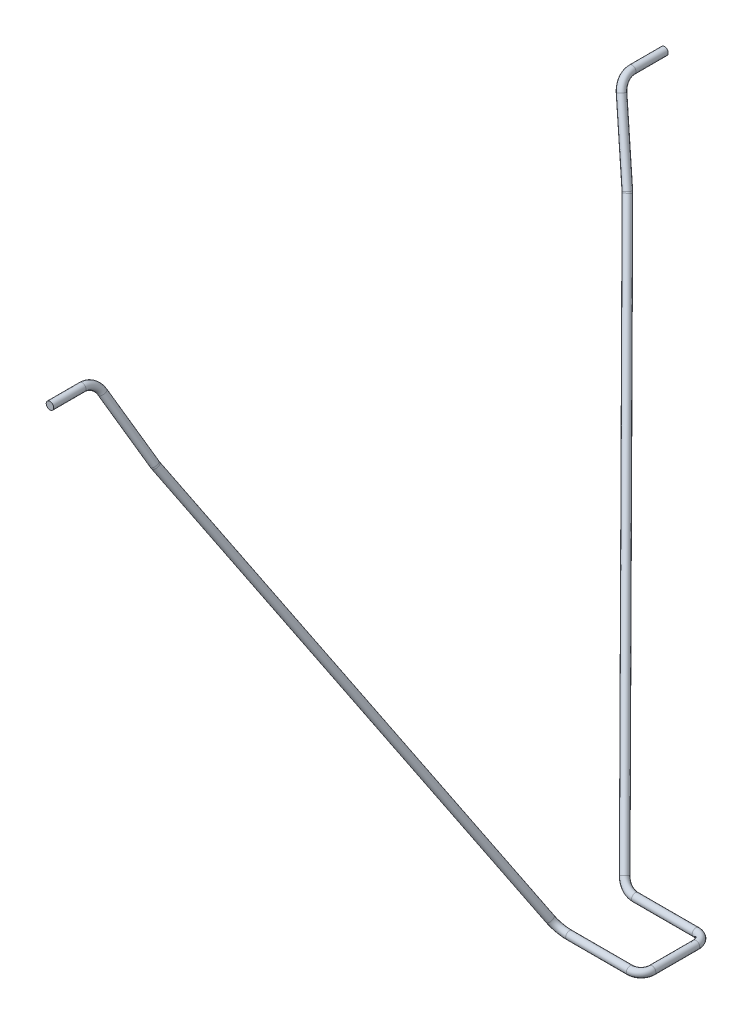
ISO-10303-21;
HEADER;
FILE_DESCRIPTION(('STEP AP214'),'2;1');
FILE_NAME('part.step','',(''),(''),'','','');
FILE_SCHEMA(('AUTOMOTIVE_DESIGN { 1 0 10303 214 1 1 1 1 }'));
ENDSEC;
DATA;
#1=APPLICATION_CONTEXT('core data for automotive mechanical design processes');
#2=APPLICATION_PROTOCOL_DEFINITION('international standard','automotive_design',2000,#1);
#3=PRODUCT_CONTEXT('',#1,'mechanical');
#4=PRODUCT('Part','Part','',(#3));
#5=PRODUCT_RELATED_PRODUCT_CATEGORY('part','',(#4));
#6=PRODUCT_DEFINITION_FORMATION('','',#4);
#7=PRODUCT_DEFINITION_CONTEXT('part definition',#1,'design');
#8=PRODUCT_DEFINITION('design','',#6,#7);
#9=PRODUCT_DEFINITION_SHAPE('','',#8);
#10=(LENGTH_UNIT() NAMED_UNIT(*) SI_UNIT(.MILLI.,.METRE.));
#11=(NAMED_UNIT(*) PLANE_ANGLE_UNIT() SI_UNIT($,.RADIAN.));
#12=(NAMED_UNIT(*) SI_UNIT($,.STERADIAN.) SOLID_ANGLE_UNIT());
#13=UNCERTAINTY_MEASURE_WITH_UNIT(LENGTH_MEASURE(1.E-05),#10,'distance_accuracy_value','');
#14=(GEOMETRIC_REPRESENTATION_CONTEXT(3) GLOBAL_UNCERTAINTY_ASSIGNED_CONTEXT((#13)) GLOBAL_UNIT_ASSIGNED_CONTEXT((#10,
#11,#12)) REPRESENTATION_CONTEXT('',''));
#15=CARTESIAN_POINT('',(0.,0.,0.));
#16=DIRECTION('',(0.,0.,1.));
#17=DIRECTION('',(1.,0.,0.));
#18=AXIS2_PLACEMENT_3D('',#15,#16,#17);
#19=CARTESIAN_POINT('',(-57.7124002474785,86.187973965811,50.104244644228));
#20=DIRECTION('',(0.,0.,1.));
#21=DIRECTION('',(1.,0.,0.));
#22=AXIS2_PLACEMENT_3D('',#19,#20,#21);
#23=CYLINDRICAL_SURFACE('',#22,0.685);
#24=CARTESIAN_POINT('',(-57.7124002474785,86.187973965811,50.104244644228));
#25=DIRECTION('',(0.,0.,1.));
#26=DIRECTION('',(0.660645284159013,-0.750698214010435,0.));
#27=AXIS2_PLACEMENT_3D('',#24,#25,#26);
#28=CIRCLE('',#27,0.685);
#29=CARTESIAN_POINT('',(-58.012684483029,86.8036478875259,50.104244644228));
#30=VERTEX_POINT('',#29);
#31=EDGE_CURVE('E42',#30,#30,#28,.T.);
#32=ORIENTED_EDGE('',*,*,#31,.T.);
#33=EDGE_LOOP('',(#32));
#34=FACE_BOUND('',#33,.T.);
#35=CARTESIAN_POINT('',(-57.7124002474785,86.187973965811,55.979804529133));
#36=DIRECTION('',(0.,0.,1.));
#37=DIRECTION('',(0.660645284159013,-0.750698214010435,0.));
#38=AXIS2_PLACEMENT_3D('',#35,#36,#37);
#39=CIRCLE('',#38,0.685);
#40=CARTESIAN_POINT('',(-57.2598582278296,85.6737456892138,55.979804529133));
#41=VERTEX_POINT('',#40);
#42=EDGE_CURVE('E12',#41,#41,#39,.T.);
#43=ORIENTED_EDGE('',*,*,#42,.F.);
#44=EDGE_LOOP('',(#43));
#45=FACE_BOUND('',#44,.T.);
#46=ADVANCED_FACE('F36',(#34,#45),#23,.T.);
#47=CARTESIAN_POINT('',(-56.3972868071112,83.4915918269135,50.104244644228));
#48=DIRECTION('',(0.898794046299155,0.438371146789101,0.));
#49=DIRECTION('',(-0.438371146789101,0.898794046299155,0.));
#50=AXIS2_PLACEMENT_3D('',#47,#48,#49);
#51=TOROIDAL_SURFACE('',#50,3.,0.685);
#52=CARTESIAN_POINT('',(-56.8320089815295,84.3829043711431,47.2728883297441));
#53=DIRECTION('',(-0.413728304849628,0.848268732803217,0.330558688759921));
#54=DIRECTION('',(0.377649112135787,-0.170470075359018,0.910121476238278));
#55=AXIS2_PLACEMENT_3D('',#52,#53,#54);
#56=CIRCLE('',#55,0.685);
#57=CARTESIAN_POINT('',(-56.9312705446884,84.5864207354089,46.6263953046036));
#58=VERTEX_POINT('',#57);
#59=EDGE_CURVE('E46',#58,#58,#56,.T.);
#60=CARTESIAN_POINT('',(-56.3972868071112,83.4915918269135,50.104244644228));
#61=DIRECTION('',(0.898794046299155,0.438371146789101,0.));
#62=DIRECTION('',(-0.438371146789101,0.898794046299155,0.));
#63=AXIS2_PLACEMENT_3D('',#60,#61,#62);
#64=CIRCLE('',#63,3.685);
#65=EDGE_CURVE('',#58,#30,#64,.T.);
#66=ORIENTED_EDGE('',*,*,#59,.T.);
#67=ORIENTED_EDGE('',*,*,#31,.F.);
#68=ORIENTED_EDGE('',*,*,#65,.T.);
#69=ORIENTED_EDGE('',*,*,#65,.F.);
#70=EDGE_LOOP('',(#66,#68,#67,#69));
#71=FACE_BOUND('',#70,.T.);
#72=ADVANCED_FACE('F155',(#71),#51,.T.);
#73=CARTESIAN_POINT('',(-51.5606669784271,73.5750516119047,43.0612163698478));
#74=DIRECTION('',(-0.413728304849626,0.848268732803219,0.330558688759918));
#75=DIRECTION('',(-0.898794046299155,-0.438371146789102,0.));
#76=AXIS2_PLACEMENT_3D('',#73,#74,#75);
#77=CYLINDRICAL_SURFACE('',#76,0.685);
#78=CARTESIAN_POINT('',(-51.5606669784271,73.5750516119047,43.0612163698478));
#79=DIRECTION('',(-0.413728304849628,0.848268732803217,0.330558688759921));
#80=DIRECTION('',(0.377649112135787,-0.170470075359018,0.910121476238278));
#81=AXIS2_PLACEMENT_3D('',#78,#79,#80);
#82=CIRCLE('',#81,0.685);
#83=CARTESIAN_POINT('',(-51.5093724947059,73.3488964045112,43.7057686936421));
#84=VERTEX_POINT('',#83);
#85=EDGE_CURVE('E50',#84,#84,#82,.T.);
#86=ORIENTED_EDGE('',*,*,#85,.T.);
#87=EDGE_LOOP('',(#86));
#88=FACE_BOUND('',#87,.T.);
#89=ORIENTED_EDGE('',*,*,#59,.F.);
#90=EDGE_LOOP('',(#89));
#91=FACE_BOUND('',#90,.T.);
#92=ADVANCED_FACE('F159',(#88,#91),#77,.T.);
#93=CARTESIAN_POINT('',(-51.7853143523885,74.5655123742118,40.2383594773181));
#94=DIRECTION('',(-0.907315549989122,-0.414051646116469,-0.0730734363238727));
#95=DIRECTION('',(0.415161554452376,-0.909747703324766,0.));
#96=AXIS2_PLACEMENT_3D('',#93,#94,#95);
#97=TOROIDAL_SURFACE('',#96,3.00000000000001,0.685);
#98=CARTESIAN_POINT('',(-51.4533454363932,73.3570261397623,42.9640442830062));
#99=DIRECTION('',(-0.405627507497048,0.816266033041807,0.411310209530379));
#100=DIRECTION('',(0.411310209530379,-0.238853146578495,0.879643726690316));
#101=AXIS2_PLACEMENT_3D('',#98,#99,#100);
#102=CIRCLE('',#101,0.685);
#103=CARTESIAN_POINT('',(-51.377545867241,73.081088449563,43.586408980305));
#104=VERTEX_POINT('',#103);
#105=EDGE_CURVE('E55',#104,#104,#102,.T.);
#106=CARTESIAN_POINT('',(-51.7853143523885,74.5655123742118,40.2383594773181));
#107=DIRECTION('',(-0.907315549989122,-0.414051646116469,-0.0730734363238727));
#108=DIRECTION('',(0.415161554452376,-0.909747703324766,0.));
#109=AXIS2_PLACEMENT_3D('',#106,#107,#108);
#110=CIRCLE('',#109,3.68500000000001);
#111=EDGE_CURVE('',#104,#84,#110,.T.);
#112=ORIENTED_EDGE('',*,*,#105,.T.);
#113=ORIENTED_EDGE('',*,*,#85,.F.);
#114=ORIENTED_EDGE('',*,*,#111,.T.);
#115=ORIENTED_EDGE('',*,*,#111,.F.);
#116=EDGE_LOOP('',(#112,#114,#113,#115));
#117=FACE_BOUND('',#116,.T.);
#118=ADVANCED_FACE('F165',(#117),#97,.T.);
#119=CARTESIAN_POINT('',(-15.7913031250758,1.59238180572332,6.80238901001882));
#120=DIRECTION('',(-0.405627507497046,0.816266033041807,0.41131020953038));
#121=DIRECTION('',(0.,-0.449992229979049,0.893032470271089));
#122=AXIS2_PLACEMENT_3D('',#119,#120,#121);
#123=CYLINDRICAL_SURFACE('',#122,0.685);
#124=CARTESIAN_POINT('',(-15.7913031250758,1.59238180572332,6.80238901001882));
#125=DIRECTION('',(-0.405627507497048,0.816266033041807,0.411310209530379));
#126=DIRECTION('',(0.411310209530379,-0.238853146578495,0.879643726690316));
#127=AXIS2_PLACEMENT_3D('',#124,#125,#126);
#128=CIRCLE('',#127,0.685);
#129=CARTESIAN_POINT('',(-16.4174194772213,1.34424840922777,6.67735648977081));
#130=VERTEX_POINT('',#129);
#131=EDGE_CURVE('E58',#130,#130,#128,.T.);
#132=ORIENTED_EDGE('',*,*,#131,.T.);
#133=EDGE_LOOP('',(#132));
#134=FACE_BOUND('',#133,.T.);
#135=ORIENTED_EDGE('',*,*,#105,.F.);
#136=EDGE_LOOP('',(#135));
#137=FACE_BOUND('',#136,.T.);
#138=ADVANCED_FACE('F172',(#134,#137),#123,.T.);
#139=CARTESIAN_POINT('',(-13.0491877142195,2.67909741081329,7.34997668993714));
#140=DIRECTION('',(0.,0.449992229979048,-0.893032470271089));
#141=DIRECTION('',(0.,0.893032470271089,0.449992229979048));
#142=AXIS2_PLACEMENT_3D('',#139,#140,#141);
#143=TOROIDAL_SURFACE('',#142,3.,0.685);
#144=CARTESIAN_POINT('',(-13.0491877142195,0.,6.));
#145=DIRECTION('',(-1.,0.,0.));
#146=DIRECTION('',(0.,0.,1.));
#147=AXIS2_PLACEMENT_3D('',#144,#145,#146);
#148=CIRCLE('',#147,0.685);
#149=CARTESIAN_POINT('',(-13.0491877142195,-0.61172724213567,5.69175532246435));
#150=VERTEX_POINT('',#149);
#151=EDGE_CURVE('E61',#150,#150,#148,.T.);
#152=CARTESIAN_POINT('',(-13.0491877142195,2.67909741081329,7.34997668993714));
#153=DIRECTION('',(0.,0.449992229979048,-0.893032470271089));
#154=DIRECTION('',(0.,0.893032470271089,0.449992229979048));
#155=AXIS2_PLACEMENT_3D('',#152,#153,#154);
#156=CIRCLE('',#155,3.685);
#157=EDGE_CURVE('',#150,#130,#156,.T.);
#158=ORIENTED_EDGE('',*,*,#151,.T.);
#159=ORIENTED_EDGE('',*,*,#131,.F.);
#160=ORIENTED_EDGE('',*,*,#157,.T.);
#161=ORIENTED_EDGE('',*,*,#157,.F.);
#162=EDGE_LOOP('',(#158,#160,#159,#161));
#163=FACE_BOUND('',#162,.T.);
#164=ADVANCED_FACE('F176',(#163),#143,.T.);
#165=CARTESIAN_POINT('',(-2.,0.,6.));
#166=DIRECTION('',(-1.,0.,0.));
#167=DIRECTION('',(0.,-1.,0.));
#168=AXIS2_PLACEMENT_3D('',#165,#166,#167);
#169=CYLINDRICAL_SURFACE('',#168,0.685);
#170=CARTESIAN_POINT('',(-2.,0.,6.));
#171=DIRECTION('',(-1.,0.,0.));
#172=DIRECTION('',(0.,0.,1.));
#173=AXIS2_PLACEMENT_3D('',#170,#171,#172);
#174=CIRCLE('',#173,0.685);
#175=CARTESIAN_POINT('',(-2.,0.,6.685));
#176=VERTEX_POINT('',#175);
#177=EDGE_CURVE('E64',#176,#176,#174,.T.);
#178=ORIENTED_EDGE('',*,*,#177,.T.);
#179=EDGE_LOOP('',(#178));
#180=FACE_BOUND('',#179,.T.);
#181=ORIENTED_EDGE('',*,*,#151,.F.);
#182=EDGE_LOOP('',(#181));
#183=FACE_BOUND('',#182,.T.);
#184=ADVANCED_FACE('F180',(#180,#183),#169,.T.);
#185=CARTESIAN_POINT('',(-2.,0.,4.));
#186=DIRECTION('',(0.,-1.,0.));
#187=DIRECTION('',(0.,0.,-1.));
#188=AXIS2_PLACEMENT_3D('',#185,#186,#187);
#189=TOROIDAL_SURFACE('',#188,2.,0.685);
#190=CARTESIAN_POINT('',(0.,0.,4.));
#191=DIRECTION('',(0.,0.,1.));
#192=DIRECTION('',(1.,0.,0.));
#193=AXIS2_PLACEMENT_3D('',#190,#191,#192);
#194=CIRCLE('',#193,0.685);
#195=CARTESIAN_POINT('',(0.685000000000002,0.,4.));
#196=VERTEX_POINT('',#195);
#197=EDGE_CURVE('E67',#196,#196,#194,.T.);
#198=CARTESIAN_POINT('',(-2.,0.,4.));
#199=DIRECTION('',(0.,-1.,0.));
#200=DIRECTION('',(0.,0.,-1.));
#201=AXIS2_PLACEMENT_3D('',#198,#199,#200);
#202=CIRCLE('',#201,2.685);
#203=EDGE_CURVE('',#196,#176,#202,.T.);
#204=ORIENTED_EDGE('',*,*,#197,.T.);
#205=ORIENTED_EDGE('',*,*,#177,.F.);
#206=ORIENTED_EDGE('',*,*,#203,.T.);
#207=ORIENTED_EDGE('',*,*,#203,.F.);
#208=EDGE_LOOP('',(#204,#206,#205,#207));
#209=FACE_BOUND('',#208,.T.);
#210=ADVANCED_FACE('F184',(#209),#189,.T.);
#211=CARTESIAN_POINT('',(0.,0.,4.));
#212=DIRECTION('',(0.,0.,-1.));
#213=DIRECTION('',(0.,1.,0.));
#214=AXIS2_PLACEMENT_3D('',#211,#212,#213);
#215=CYLINDRICAL_SURFACE('',#214,0.685);
#216=ORIENTED_EDGE('',*,*,#197,.F.);
#217=EDGE_LOOP('',(#216));
#218=FACE_BOUND('',#217,.T.);
#219=CARTESIAN_POINT('',(0.,0.,-4.));
#220=DIRECTION('',(0.,0.,1.));
#221=DIRECTION('',(1.,0.,0.));
#222=AXIS2_PLACEMENT_3D('',#219,#220,#221);
#223=CIRCLE('',#222,0.685);
#224=CARTESIAN_POINT('',(0.685000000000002,0.,-4.));
#225=VERTEX_POINT('',#224);
#226=EDGE_CURVE('E94',#225,#225,#223,.T.);
#227=ORIENTED_EDGE('',*,*,#226,.T.);
#228=EDGE_LOOP('',(#227));
#229=FACE_BOUND('',#228,.T.);
#230=ADVANCED_FACE('F98',(#218,#229),#215,.T.);
#231=CARTESIAN_POINT('',(-57.7124002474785,86.187973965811,55.979804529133));
#232=DIRECTION('',(0.,0.,1.));
#233=DIRECTION('',(0.660645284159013,-0.750698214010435,0.));
#234=AXIS2_PLACEMENT_3D('',#231,#232,#233);
#235=PLANE('',#234);
#236=ORIENTED_EDGE('',*,*,#42,.T.);
#237=EDGE_LOOP('',(#236));
#238=FACE_BOUND('',#237,.T.);
#239=ADVANCED_FACE('F146',(#238),#235,.T.);
#240=CARTESIAN_POINT('',(-57.7124002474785,86.187973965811,-50.104244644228));
#241=DIRECTION('',(0.,0.,-1.));
#242=DIRECTION('',(-1.,0.,0.));
#243=AXIS2_PLACEMENT_3D('',#240,#241,#242);
#244=CYLINDRICAL_SURFACE('',#243,0.685);
#245=CARTESIAN_POINT('',(-57.7124002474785,86.187973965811,-50.104244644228));
#246=DIRECTION('',(0.,0.,1.));
#247=DIRECTION('',(0.660645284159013,-0.750698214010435,0.));
#248=AXIS2_PLACEMENT_3D('',#245,#246,#247);
#249=CIRCLE('',#248,0.685);
#250=CARTESIAN_POINT('',(-58.012684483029,86.8036478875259,-50.104244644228));
#251=VERTEX_POINT('',#250);
#252=EDGE_CURVE('E73',#251,#251,#249,.T.);
#253=ORIENTED_EDGE('',*,*,#252,.F.);
#254=EDGE_LOOP('',(#253));
#255=FACE_BOUND('',#254,.T.);
#256=CARTESIAN_POINT('',(-57.7124002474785,86.187973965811,-55.979804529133));
#257=DIRECTION('',(0.,0.,1.));
#258=DIRECTION('',(0.660645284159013,-0.750698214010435,0.));
#259=AXIS2_PLACEMENT_3D('',#256,#257,#258);
#260=CIRCLE('',#259,0.685);
#261=CARTESIAN_POINT('',(-57.2598582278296,85.6737456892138,-55.979804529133));
#262=VERTEX_POINT('',#261);
#263=EDGE_CURVE('E70',#262,#262,#260,.T.);
#264=ORIENTED_EDGE('',*,*,#263,.T.);
#265=EDGE_LOOP('',(#264));
#266=FACE_BOUND('',#265,.T.);
#267=ADVANCED_FACE('F140',(#255,#266),#244,.T.);
#268=CARTESIAN_POINT('',(-56.3972868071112,83.4915918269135,-50.104244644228));
#269=DIRECTION('',(-0.898794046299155,-0.438371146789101,0.));
#270=DIRECTION('',(0.438371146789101,-0.898794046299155,0.));
#271=AXIS2_PLACEMENT_3D('',#268,#269,#270);
#272=TOROIDAL_SURFACE('',#271,3.,0.685);
#273=CARTESIAN_POINT('',(-56.8320089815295,84.3829043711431,-47.2728883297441));
#274=DIRECTION('',(0.413728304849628,-0.848268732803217,0.330558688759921));
#275=DIRECTION('',(0.377649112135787,-0.170470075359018,-0.910121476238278));
#276=AXIS2_PLACEMENT_3D('',#273,#274,#275);
#277=CIRCLE('',#276,0.685);
#278=CARTESIAN_POINT('',(-56.9312705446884,84.5864207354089,-46.6263953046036));
#279=VERTEX_POINT('',#278);
#280=EDGE_CURVE('E76',#279,#279,#277,.T.);
#281=CARTESIAN_POINT('',(-56.3972868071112,83.4915918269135,-50.104244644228));
#282=DIRECTION('',(-0.898794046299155,-0.438371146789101,0.));
#283=DIRECTION('',(0.438371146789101,-0.898794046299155,0.));
#284=AXIS2_PLACEMENT_3D('',#281,#282,#283);
#285=CIRCLE('',#284,3.685);
#286=EDGE_CURVE('',#279,#251,#285,.T.);
#287=ORIENTED_EDGE('',*,*,#280,.F.);
#288=ORIENTED_EDGE('',*,*,#252,.T.);
#289=ORIENTED_EDGE('',*,*,#286,.T.);
#290=ORIENTED_EDGE('',*,*,#286,.F.);
#291=EDGE_LOOP('',(#287,#289,#288,#290));
#292=FACE_BOUND('',#291,.T.);
#293=ADVANCED_FACE('F134',(#292),#272,.T.);
#294=CARTESIAN_POINT('',(-51.5606669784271,73.5750516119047,-43.0612163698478));
#295=DIRECTION('',(-0.413728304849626,0.848268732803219,-0.330558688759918));
#296=DIRECTION('',(-0.898794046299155,-0.438371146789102,0.));
#297=AXIS2_PLACEMENT_3D('',#294,#295,#296);
#298=CYLINDRICAL_SURFACE('',#297,0.685);
#299=CARTESIAN_POINT('',(-51.5606669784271,73.5750516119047,-43.0612163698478));
#300=DIRECTION('',(0.413728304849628,-0.848268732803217,0.330558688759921));
#301=DIRECTION('',(0.377649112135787,-0.170470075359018,-0.910121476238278));
#302=AXIS2_PLACEMENT_3D('',#299,#300,#301);
#303=CIRCLE('',#302,0.685);
#304=CARTESIAN_POINT('',(-51.5093724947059,73.3488964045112,-43.7057686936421));
#305=VERTEX_POINT('',#304);
#306=EDGE_CURVE('E79',#305,#305,#303,.T.);
#307=ORIENTED_EDGE('',*,*,#306,.F.);
#308=EDGE_LOOP('',(#307));
#309=FACE_BOUND('',#308,.T.);
#310=ORIENTED_EDGE('',*,*,#280,.T.);
#311=EDGE_LOOP('',(#310));
#312=FACE_BOUND('',#311,.T.);
#313=ADVANCED_FACE('F128',(#309,#312),#298,.T.);
#314=CARTESIAN_POINT('',(-51.7853143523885,74.5655123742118,-40.2383594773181));
#315=DIRECTION('',(0.907315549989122,0.414051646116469,-0.0730734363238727));
#316=DIRECTION('',(-0.415161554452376,0.909747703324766,0.));
#317=AXIS2_PLACEMENT_3D('',#314,#315,#316);
#318=TOROIDAL_SURFACE('',#317,3.00000000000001,0.685);
#319=CARTESIAN_POINT('',(-51.4533454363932,73.3570261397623,-42.9640442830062));
#320=DIRECTION('',(0.405627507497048,-0.816266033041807,0.411310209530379));
#321=DIRECTION('',(0.411310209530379,-0.238853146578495,-0.879643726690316));
#322=AXIS2_PLACEMENT_3D('',#319,#320,#321);
#323=CIRCLE('',#322,0.685);
#324=CARTESIAN_POINT('',(-51.377545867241,73.081088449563,-43.586408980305));
#325=VERTEX_POINT('',#324);
#326=EDGE_CURVE('E82',#325,#325,#323,.T.);
#327=CARTESIAN_POINT('',(-51.7853143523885,74.5655123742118,-40.2383594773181));
#328=DIRECTION('',(0.907315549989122,0.414051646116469,-0.0730734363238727));
#329=DIRECTION('',(-0.415161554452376,0.909747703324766,0.));
#330=AXIS2_PLACEMENT_3D('',#327,#328,#329);
#331=CIRCLE('',#330,3.68500000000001);
#332=EDGE_CURVE('',#325,#305,#331,.T.);
#333=ORIENTED_EDGE('',*,*,#326,.F.);
#334=ORIENTED_EDGE('',*,*,#306,.T.);
#335=ORIENTED_EDGE('',*,*,#332,.T.);
#336=ORIENTED_EDGE('',*,*,#332,.F.);
#337=EDGE_LOOP('',(#333,#335,#334,#336));
#338=FACE_BOUND('',#337,.T.);
#339=ADVANCED_FACE('F122',(#338),#318,.T.);
#340=CARTESIAN_POINT('',(-15.7913031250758,1.59238180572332,-6.80238901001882));
#341=DIRECTION('',(-0.405627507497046,0.816266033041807,-0.41131020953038));
#342=DIRECTION('',(0.,0.449992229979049,0.893032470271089));
#343=AXIS2_PLACEMENT_3D('',#340,#341,#342);
#344=CYLINDRICAL_SURFACE('',#343,0.685);
#345=CARTESIAN_POINT('',(-15.7913031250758,1.59238180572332,-6.80238901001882));
#346=DIRECTION('',(0.405627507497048,-0.816266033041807,0.411310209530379));
#347=DIRECTION('',(0.411310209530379,-0.238853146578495,-0.879643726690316));
#348=AXIS2_PLACEMENT_3D('',#345,#346,#347);
#349=CIRCLE('',#348,0.685);
#350=CARTESIAN_POINT('',(-16.4174194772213,1.34424840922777,-6.67735648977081));
#351=VERTEX_POINT('',#350);
#352=EDGE_CURVE('E85',#351,#351,#349,.T.);
#353=ORIENTED_EDGE('',*,*,#352,.F.);
#354=EDGE_LOOP('',(#353));
#355=FACE_BOUND('',#354,.T.);
#356=ORIENTED_EDGE('',*,*,#326,.T.);
#357=EDGE_LOOP('',(#356));
#358=FACE_BOUND('',#357,.T.);
#359=ADVANCED_FACE('F116',(#355,#358),#344,.T.);
#360=CARTESIAN_POINT('',(-13.0491877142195,2.67909741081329,-7.34997668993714));
#361=DIRECTION('',(0.,-0.449992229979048,-0.893032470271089));
#362=DIRECTION('',(0.,0.893032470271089,-0.449992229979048));
#363=AXIS2_PLACEMENT_3D('',#360,#361,#362);
#364=TOROIDAL_SURFACE('',#363,3.,0.685);
#365=CARTESIAN_POINT('',(-13.0491877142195,0.,-6.));
#366=DIRECTION('',(1.,0.,0.));
#367=DIRECTION('',(0.,0.,-1.));
#368=AXIS2_PLACEMENT_3D('',#365,#366,#367);
#369=CIRCLE('',#368,0.685);
#370=CARTESIAN_POINT('',(-13.0491877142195,-0.61172724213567,-5.69175532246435));
#371=VERTEX_POINT('',#370);
#372=EDGE_CURVE('E88',#371,#371,#369,.T.);
#373=CARTESIAN_POINT('',(-13.0491877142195,2.67909741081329,-7.34997668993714));
#374=DIRECTION('',(0.,-0.449992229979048,-0.893032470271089));
#375=DIRECTION('',(0.,0.893032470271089,-0.449992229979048));
#376=AXIS2_PLACEMENT_3D('',#373,#374,#375);
#377=CIRCLE('',#376,3.685);
#378=EDGE_CURVE('',#371,#351,#377,.T.);
#379=ORIENTED_EDGE('',*,*,#372,.F.);
#380=ORIENTED_EDGE('',*,*,#352,.T.);
#381=ORIENTED_EDGE('',*,*,#378,.T.);
#382=ORIENTED_EDGE('',*,*,#378,.F.);
#383=EDGE_LOOP('',(#379,#381,#380,#382));
#384=FACE_BOUND('',#383,.T.);
#385=ADVANCED_FACE('F110',(#384),#364,.T.);
#386=CARTESIAN_POINT('',(-2.,0.,-6.));
#387=DIRECTION('',(-1.,0.,0.));
#388=DIRECTION('',(0.,-1.,0.));
#389=AXIS2_PLACEMENT_3D('',#386,#387,#388);
#390=CYLINDRICAL_SURFACE('',#389,0.685);
#391=CARTESIAN_POINT('',(-2.,0.,-6.));
#392=DIRECTION('',(1.,0.,0.));
#393=DIRECTION('',(0.,0.,-1.));
#394=AXIS2_PLACEMENT_3D('',#391,#392,#393);
#395=CIRCLE('',#394,0.685);
#396=CARTESIAN_POINT('',(-2.,0.,-6.685));
#397=VERTEX_POINT('',#396);
#398=EDGE_CURVE('E91',#397,#397,#395,.T.);
#399=ORIENTED_EDGE('',*,*,#398,.F.);
#400=EDGE_LOOP('',(#399));
#401=FACE_BOUND('',#400,.T.);
#402=ORIENTED_EDGE('',*,*,#372,.T.);
#403=EDGE_LOOP('',(#402));
#404=FACE_BOUND('',#403,.T.);
#405=ADVANCED_FACE('F104',(#401,#404),#390,.T.);
#406=CARTESIAN_POINT('',(-2.,0.,-4.));
#407=DIRECTION('',(0.,1.,0.));
#408=DIRECTION('',(0.,0.,1.));
#409=AXIS2_PLACEMENT_3D('',#406,#407,#408);
#410=TOROIDAL_SURFACE('',#409,2.,0.685);
#411=CARTESIAN_POINT('',(-2.,0.,-4.));
#412=DIRECTION('',(0.,1.,0.));
#413=DIRECTION('',(0.,0.,1.));
#414=AXIS2_PLACEMENT_3D('',#411,#412,#413);
#415=CIRCLE('',#414,2.685);
#416=EDGE_CURVE('',#225,#397,#415,.T.);
#417=ORIENTED_EDGE('',*,*,#226,.F.);
#418=ORIENTED_EDGE('',*,*,#398,.T.);
#419=ORIENTED_EDGE('',*,*,#416,.T.);
#420=ORIENTED_EDGE('',*,*,#416,.F.);
#421=EDGE_LOOP('',(#417,#419,#418,#420));
#422=FACE_BOUND('',#421,.T.);
#423=ADVANCED_FACE('F100',(#422),#410,.T.);
#424=CARTESIAN_POINT('',(-57.7124002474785,86.187973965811,-55.979804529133));
#425=DIRECTION('',(0.,0.,-1.));
#426=DIRECTION('',(0.660645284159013,-0.750698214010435,0.));
#427=AXIS2_PLACEMENT_3D('',#424,#425,#426);
#428=PLANE('',#427);
#429=ORIENTED_EDGE('',*,*,#263,.F.);
#430=EDGE_LOOP('',(#429));
#431=FACE_BOUND('',#430,.T.);
#432=ADVANCED_FACE('F103',(#431),#428,.T.);
#433=CLOSED_SHELL('',(#46,#72,#92,#118,#138,#164,#184,#210,#230,#239,#267,#293,#313,#339,#359,
#385,#405,#423,#432));
#434=MANIFOLD_SOLID_BREP('B2',#433);
#435=ADVANCED_BREP_SHAPE_REPRESENTATION('',(#18,#434),#14);
#436=SHAPE_DEFINITION_REPRESENTATION(#9,#435);
ENDSEC;
END-ISO-10303-21;
